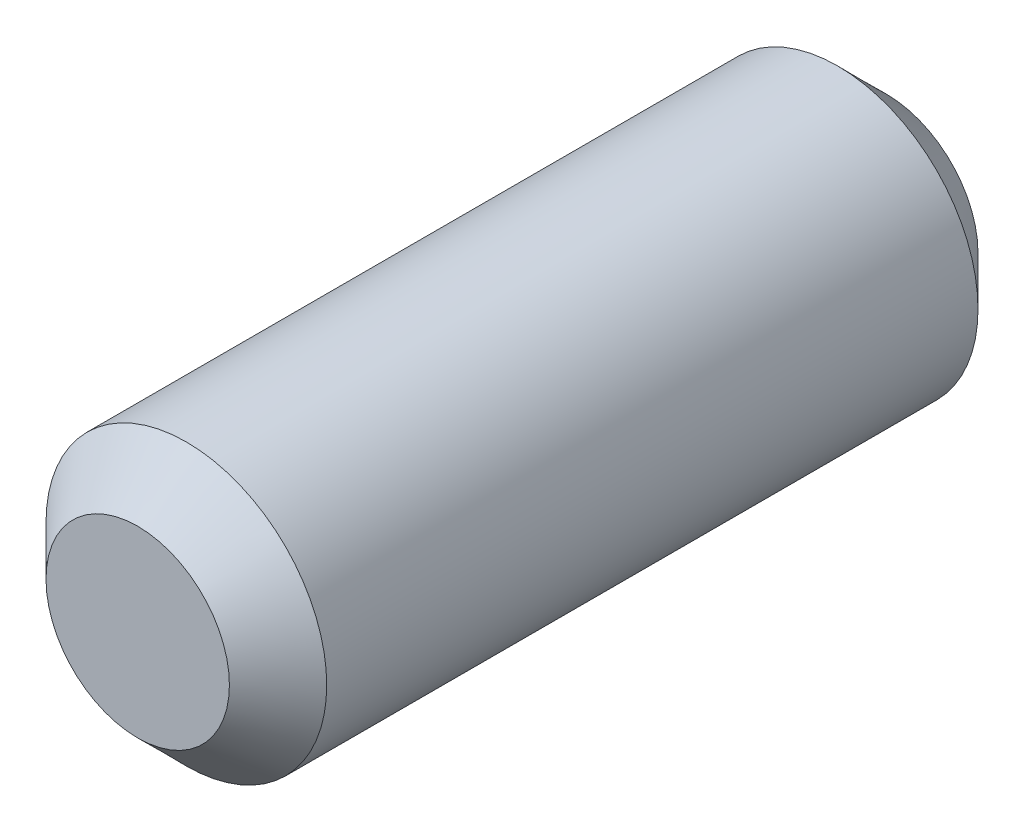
ISO-10303-21;
HEADER;
FILE_DESCRIPTION(('STEP AP214'),'2;1');
FILE_NAME('part.step','',(''),(''),'','','');
FILE_SCHEMA(('AUTOMOTIVE_DESIGN { 1 0 10303 214 1 1 1 1 }'));
ENDSEC;
DATA;
#1=APPLICATION_CONTEXT('core data for automotive mechanical design processes');
#2=APPLICATION_PROTOCOL_DEFINITION('international standard','automotive_design',2000,#1);
#3=PRODUCT_CONTEXT('',#1,'mechanical');
#4=PRODUCT('Part','Part','',(#3));
#5=PRODUCT_RELATED_PRODUCT_CATEGORY('part','',(#4));
#6=PRODUCT_DEFINITION_FORMATION('','',#4);
#7=PRODUCT_DEFINITION_CONTEXT('part definition',#1,'design');
#8=PRODUCT_DEFINITION('design','',#6,#7);
#9=PRODUCT_DEFINITION_SHAPE('','',#8);
#10=(LENGTH_UNIT() NAMED_UNIT(*) SI_UNIT(.MILLI.,.METRE.));
#11=(NAMED_UNIT(*) PLANE_ANGLE_UNIT() SI_UNIT($,.RADIAN.));
#12=(NAMED_UNIT(*) SI_UNIT($,.STERADIAN.) SOLID_ANGLE_UNIT());
#13=UNCERTAINTY_MEASURE_WITH_UNIT(LENGTH_MEASURE(1.E-05),#10,'distance_accuracy_value','');
#14=(GEOMETRIC_REPRESENTATION_CONTEXT(3) GLOBAL_UNCERTAINTY_ASSIGNED_CONTEXT((#13)) GLOBAL_UNIT_ASSIGNED_CONTEXT((#10,
#11,#12)) REPRESENTATION_CONTEXT('',''));
#15=CARTESIAN_POINT('',(0.,0.,0.));
#16=DIRECTION('',(0.,0.,1.));
#17=DIRECTION('',(1.,0.,0.));
#18=AXIS2_PLACEMENT_3D('',#15,#16,#17);
#19=CARTESIAN_POINT('',(0.,0.,6.35));
#20=DIRECTION('',(0.,0.,-1.));
#21=DIRECTION('',(-1.,0.,0.));
#22=AXIS2_PLACEMENT_3D('',#19,#20,#21);
#23=CYLINDRICAL_SURFACE('',#22,2.38125);
#24=CARTESIAN_POINT('',(0.,0.,-5.5245));
#25=DIRECTION('',(0.,0.,1.));
#26=DIRECTION('',(1.,0.,0.));
#27=AXIS2_PLACEMENT_3D('',#24,#25,#26);
#28=CIRCLE('',#27,2.38125);
#29=CARTESIAN_POINT('',(2.38125,0.,-5.5245));
#30=VERTEX_POINT('',#29);
#31=EDGE_CURVE('E34',#30,#30,#28,.T.);
#32=ORIENTED_EDGE('',*,*,#31,.T.);
#33=EDGE_LOOP('',(#32));
#34=FACE_BOUND('',#33,.T.);
#35=CARTESIAN_POINT('',(0.,0.,5.5245));
#36=DIRECTION('',(0.,0.,1.));
#37=DIRECTION('',(1.,0.,0.));
#38=AXIS2_PLACEMENT_3D('',#35,#36,#37);
#39=CIRCLE('',#38,2.38125);
#40=CARTESIAN_POINT('',(2.38125,0.,5.5245));
#41=VERTEX_POINT('',#40);
#42=EDGE_CURVE('E38',#41,#41,#39,.F.);
#43=ORIENTED_EDGE('',*,*,#42,.T.);
#44=EDGE_LOOP('',(#43));
#45=FACE_BOUND('',#44,.T.);
#46=ADVANCED_FACE('F24',(#34,#45),#23,.T.);
#47=CARTESIAN_POINT('',(0.,0.,6.35));
#48=DIRECTION('',(0.,0.,1.));
#49=DIRECTION('',(1.,0.,0.));
#50=AXIS2_PLACEMENT_3D('',#47,#48,#49);
#51=PLANE('',#50);
#52=CARTESIAN_POINT('',(0.,0.,6.35));
#53=DIRECTION('',(0.,0.,1.));
#54=DIRECTION('',(1.,0.,0.));
#55=AXIS2_PLACEMENT_3D('',#52,#53,#54);
#56=CIRCLE('',#55,1.55575);
#57=CARTESIAN_POINT('',(1.55575,0.,6.35));
#58=VERTEX_POINT('',#57);
#59=EDGE_CURVE('E10',#58,#58,#56,.T.);
#60=ORIENTED_EDGE('',*,*,#59,.T.);
#61=EDGE_LOOP('',(#60));
#62=FACE_BOUND('',#61,.T.);
#63=ADVANCED_FACE('F57',(#62),#51,.T.);
#64=CARTESIAN_POINT('',(0.,0.,-6.35));
#65=DIRECTION('',(0.,0.,1.));
#66=DIRECTION('',(1.,0.,0.));
#67=AXIS2_PLACEMENT_3D('',#64,#65,#66);
#68=PLANE('',#67);
#69=CARTESIAN_POINT('',(0.,0.,-6.35));
#70=DIRECTION('',(0.,0.,1.));
#71=DIRECTION('',(1.,0.,0.));
#72=AXIS2_PLACEMENT_3D('',#69,#70,#71);
#73=CIRCLE('',#72,1.55575);
#74=CARTESIAN_POINT('',(1.55575,0.,-6.35));
#75=VERTEX_POINT('',#74);
#76=EDGE_CURVE('E30',#75,#75,#73,.F.);
#77=ORIENTED_EDGE('',*,*,#76,.T.);
#78=EDGE_LOOP('',(#77));
#79=FACE_BOUND('',#78,.T.);
#80=ADVANCED_FACE('F53',(#79),#68,.F.);
#81=CARTESIAN_POINT('',(0.,0.,-5.5245));
#82=DIRECTION('',(0.,0.,1.));
#83=DIRECTION('',(1.,0.,0.));
#84=AXIS2_PLACEMENT_3D('',#81,#82,#83);
#85=CONICAL_SURFACE('',#84,2.38125,0.785398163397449);
#86=ORIENTED_EDGE('',*,*,#76,.F.);
#87=EDGE_LOOP('',(#86));
#88=FACE_BOUND('',#87,.T.);
#89=ORIENTED_EDGE('',*,*,#31,.F.);
#90=EDGE_LOOP('',(#89));
#91=FACE_BOUND('',#90,.T.);
#92=ADVANCED_FACE('F48',(#88,#91),#85,.T.);
#93=CARTESIAN_POINT('',(0.,0.,6.35));
#94=DIRECTION('',(0.,0.,-1.));
#95=DIRECTION('',(-1.,0.,0.));
#96=AXIS2_PLACEMENT_3D('',#93,#94,#95);
#97=CONICAL_SURFACE('',#96,1.55575,0.785398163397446);
#98=ORIENTED_EDGE('',*,*,#42,.F.);
#99=EDGE_LOOP('',(#98));
#100=FACE_BOUND('',#99,.T.);
#101=ORIENTED_EDGE('',*,*,#59,.F.);
#102=EDGE_LOOP('',(#101));
#103=FACE_BOUND('',#102,.T.);
#104=ADVANCED_FACE('F45',(#100,#103),#97,.T.);
#105=CLOSED_SHELL('',(#46,#63,#80,#92,#104));
#106=MANIFOLD_SOLID_BREP('B2',#105);
#107=ADVANCED_BREP_SHAPE_REPRESENTATION('',(#18,#106),#14);
#108=SHAPE_DEFINITION_REPRESENTATION(#9,#107);
ENDSEC;
END-ISO-10303-21;
